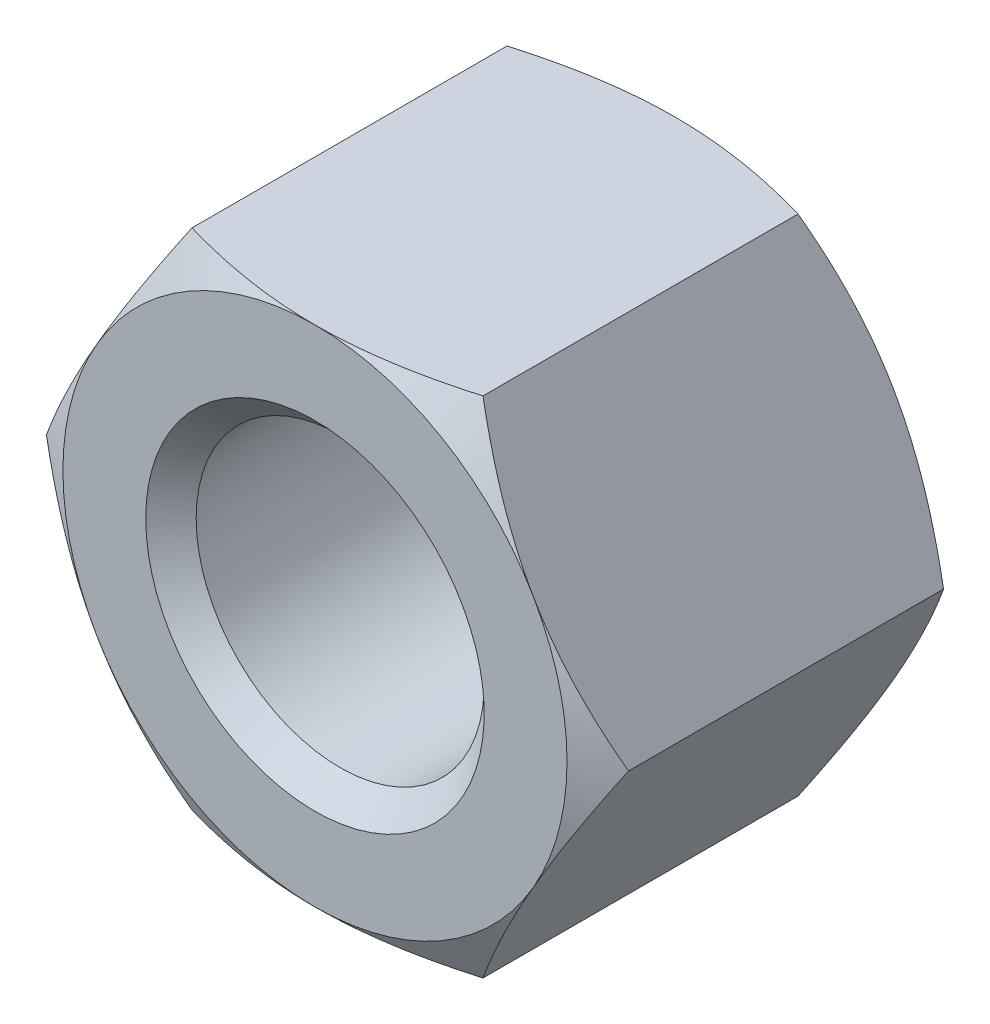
ISO-10303-21;
HEADER;
FILE_DESCRIPTION(('STEP AP214'),'2;1');
FILE_NAME('part.step','',(''),(''),'','','');
FILE_SCHEMA(('AUTOMOTIVE_DESIGN { 1 0 10303 214 1 1 1 1 }'));
ENDSEC;
DATA;
#1=APPLICATION_CONTEXT('core data for automotive mechanical design processes');
#2=APPLICATION_PROTOCOL_DEFINITION('international standard','automotive_design',2000,#1);
#3=PRODUCT_CONTEXT('',#1,'mechanical');
#4=PRODUCT('Part','Part','',(#3));
#5=PRODUCT_RELATED_PRODUCT_CATEGORY('part','',(#4));
#6=PRODUCT_DEFINITION_FORMATION('','',#4);
#7=PRODUCT_DEFINITION_CONTEXT('part definition',#1,'design');
#8=PRODUCT_DEFINITION('design','',#6,#7);
#9=PRODUCT_DEFINITION_SHAPE('','',#8);
#10=(LENGTH_UNIT() NAMED_UNIT(*) SI_UNIT(.MILLI.,.METRE.));
#11=(NAMED_UNIT(*) PLANE_ANGLE_UNIT() SI_UNIT($,.RADIAN.));
#12=(NAMED_UNIT(*) SI_UNIT($,.STERADIAN.) SOLID_ANGLE_UNIT());
#13=UNCERTAINTY_MEASURE_WITH_UNIT(LENGTH_MEASURE(1.E-05),#10,'distance_accuracy_value','');
#14=(GEOMETRIC_REPRESENTATION_CONTEXT(3) GLOBAL_UNCERTAINTY_ASSIGNED_CONTEXT((#13)) GLOBAL_UNIT_ASSIGNED_CONTEXT((#10,
#11,#12)) REPRESENTATION_CONTEXT('',''));
#15=CARTESIAN_POINT('',(0.,0.,0.));
#16=DIRECTION('',(0.,0.,1.));
#17=DIRECTION('',(1.,0.,0.));
#18=AXIS2_PLACEMENT_3D('',#15,#16,#17);
#19=CARTESIAN_POINT('',(4.04145188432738,0.,-2.5));
#20=DIRECTION('',(0.866025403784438,0.5,0.));
#21=DIRECTION('',(-0.5,0.866025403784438,0.));
#22=AXIS2_PLACEMENT_3D('',#19,#20,#21);
#23=PLANE('',#22);
#24=CARTESIAN_POINT('',(4.04156735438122,-0.000200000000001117,2.18732593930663));
#25=CARTESIAN_POINT('',(3.9527667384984,0.153607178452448,2.23861421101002));
#26=CARTESIAN_POINT('',(3.86319960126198,0.308742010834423,2.2852590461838));
#27=CARTESIAN_POINT('',(3.68251437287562,0.62169800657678,2.36667812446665));
#28=CARTESIAN_POINT('',(3.59139307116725,0.779524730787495,2.40142356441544));
#29=CARTESIAN_POINT('',(3.41027974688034,1.09322221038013,2.45550997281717));
#30=CARTESIAN_POINT('',(3.32031559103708,1.24904469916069,2.47521091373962));
#31=CARTESIAN_POINT('',(3.13996396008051,1.56142288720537,2.49872986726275));
#32=CARTESIAN_POINT('',(3.04957714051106,1.71797745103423,2.50256735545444));
#33=CARTESIAN_POINT('',(2.88068384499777,2.01050921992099,2.49458469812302));
#34=CARTESIAN_POINT('',(2.80215208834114,2.14653021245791,2.48472456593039));
#35=CARTESIAN_POINT('',(2.64560020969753,2.41768602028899,2.4534735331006));
#36=CARTESIAN_POINT('',(2.56758062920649,2.55281989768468,2.4320719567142));
#37=CARTESIAN_POINT('',(2.41070596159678,2.82453479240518,2.37856959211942));
#38=CARTESIAN_POINT('',(2.33187072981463,2.96108141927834,2.34624200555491));
#39=CARTESIAN_POINT('',(2.17537608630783,3.2321380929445,2.27287106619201));
#40=CARTESIAN_POINT('',(2.09771466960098,3.36665161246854,2.23184495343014));
#41=CARTESIAN_POINT('',(2.02061047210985,3.5002,2.18732593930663));
#42=B_SPLINE_CURVE_WITH_KNOTS('',3,(#24,#25,#26,#27,#28,#29,#30,#31,#32,#33,#34,#35,#36,#37,#38,
#39,#40,#41),.UNSPECIFIED.,.F.,.F.,(4,2,2,2,2,2,2,2,4),(0.,0.554793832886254,1.11092123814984,
1.65328467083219,2.19498204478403,2.6666513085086,3.13875761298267,3.6213361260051,
4.10296698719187),.UNSPECIFIED.);
#43=CARTESIAN_POINT('',(4.04145188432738,0.,2.18739260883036));
#44=VERTEX_POINT('',#43);
#45=CARTESIAN_POINT('',(3.03108891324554,1.75,2.5));
#46=VERTEX_POINT('',#45);
#47=EDGE_CURVE('E127',#44,#46,#42,.T.);
#48=ORIENTED_EDGE('',*,*,#47,.F.);
#49=DIRECTION('',(0.,0.,1.));
#50=VECTOR('',#49,1.);
#51=CARTESIAN_POINT('',(4.04145188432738,0.,-2.5));
#52=LINE('',#51,#50);
#53=CARTESIAN_POINT('',(4.04145188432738,0.,-2.18739260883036));
#54=VERTEX_POINT('',#53);
#55=EDGE_CURVE('E535',#54,#44,#52,.T.);
#56=ORIENTED_EDGE('',*,*,#55,.F.);
#57=CARTESIAN_POINT('',(4.04156735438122,-0.000200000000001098,-2.18732593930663));
#58=CARTESIAN_POINT('',(3.9527667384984,0.153607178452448,-2.23861421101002));
#59=CARTESIAN_POINT('',(3.86319960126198,0.308742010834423,-2.2852590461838));
#60=CARTESIAN_POINT('',(3.68251437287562,0.62169800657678,-2.36667812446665));
#61=CARTESIAN_POINT('',(3.59139307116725,0.779524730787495,-2.40142356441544));
#62=CARTESIAN_POINT('',(3.41027974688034,1.09322221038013,-2.45550997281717));
#63=CARTESIAN_POINT('',(3.32031559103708,1.24904469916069,-2.47521091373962));
#64=CARTESIAN_POINT('',(3.13996396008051,1.56142288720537,-2.49872986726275));
#65=CARTESIAN_POINT('',(3.04957714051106,1.71797745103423,-2.50256735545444));
#66=CARTESIAN_POINT('',(2.88068384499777,2.01050921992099,-2.49458469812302));
#67=CARTESIAN_POINT('',(2.80215208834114,2.14653021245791,-2.48472456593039));
#68=CARTESIAN_POINT('',(2.64560020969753,2.41768602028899,-2.4534735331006));
#69=CARTESIAN_POINT('',(2.56758062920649,2.55281989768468,-2.4320719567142));
#70=CARTESIAN_POINT('',(2.41070596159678,2.82453479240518,-2.37856959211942));
#71=CARTESIAN_POINT('',(2.33187072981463,2.96108141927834,-2.34624200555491));
#72=CARTESIAN_POINT('',(2.17537608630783,3.2321380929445,-2.27287106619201));
#73=CARTESIAN_POINT('',(2.09771466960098,3.36665161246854,-2.23184495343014));
#74=CARTESIAN_POINT('',(2.02061047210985,3.5002,-2.18732593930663));
#75=B_SPLINE_CURVE_WITH_KNOTS('',3,(#57,#58,#59,#60,#61,#62,#63,#64,#65,#66,#67,#68,#69,#70,#71,
#72,#73,#74),.UNSPECIFIED.,.F.,.F.,(4,2,2,2,2,2,2,2,4),(0.,0.554793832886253,1.11092123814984,
1.65328467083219,2.19498204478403,2.6666513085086,3.13875761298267,3.6213361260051,
4.10296698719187),.UNSPECIFIED.);
#76=CARTESIAN_POINT('',(3.03108891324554,1.75,-2.5));
#77=VERTEX_POINT('',#76);
#78=EDGE_CURVE('E569',#54,#77,#75,.T.);
#79=ORIENTED_EDGE('',*,*,#78,.T.);
#80=CARTESIAN_POINT('',(2.02072594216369,3.5,-2.18739260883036));
#81=VERTEX_POINT('',#80);
#82=EDGE_CURVE('E269',#77,#81,#75,.T.);
#83=ORIENTED_EDGE('',*,*,#82,.T.);
#84=DIRECTION('',(0.,0.,1.));
#85=VECTOR('',#84,1.);
#86=CARTESIAN_POINT('',(2.02072594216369,3.5,-2.5));
#87=LINE('',#86,#85);
#88=CARTESIAN_POINT('',(2.02072594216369,3.5,2.18739260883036));
#89=VERTEX_POINT('',#88);
#90=EDGE_CURVE('E159',#81,#89,#87,.T.);
#91=ORIENTED_EDGE('',*,*,#90,.T.);
#92=EDGE_CURVE('E140',#46,#89,#42,.T.);
#93=ORIENTED_EDGE('',*,*,#92,.F.);
#94=EDGE_LOOP('',(#48,#56,#79,#83,#91,#93));
#95=FACE_BOUND('',#94,.T.);
#96=ADVANCED_FACE('F41',(#95),#23,.T.);
#97=CARTESIAN_POINT('',(2.02072594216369,-3.5,-2.5));
#98=DIRECTION('',(0.866025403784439,-0.5,0.));
#99=DIRECTION('',(0.5,0.866025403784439,0.));
#100=AXIS2_PLACEMENT_3D('',#97,#98,#99);
#101=PLANE('',#100);
#102=CARTESIAN_POINT('',(2.02061047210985,-3.5002,2.18732593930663));
#103=CARTESIAN_POINT('',(2.10941108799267,-3.34639282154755,2.23861421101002));
#104=CARTESIAN_POINT('',(2.19897822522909,-3.19125798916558,2.2852590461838));
#105=CARTESIAN_POINT('',(2.37966345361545,-2.87830199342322,2.36667812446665));
#106=CARTESIAN_POINT('',(2.47078475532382,-2.7204752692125,2.40142356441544));
#107=CARTESIAN_POINT('',(2.65189807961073,-2.40677778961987,2.45550997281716));
#108=CARTESIAN_POINT('',(2.74186223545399,-2.25095530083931,2.47521091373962));
#109=CARTESIAN_POINT('',(2.92221386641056,-1.93857711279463,2.49872986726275));
#110=CARTESIAN_POINT('',(3.01260068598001,-1.78202254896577,2.50256735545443));
#111=CARTESIAN_POINT('',(3.1814939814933,-1.48949078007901,2.49458469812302));
#112=CARTESIAN_POINT('',(3.26002573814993,-1.35346978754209,2.48472456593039));
#113=CARTESIAN_POINT('',(3.41657761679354,-1.08231397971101,2.4534735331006));
#114=CARTESIAN_POINT('',(3.49459719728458,-0.947180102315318,2.4320719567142));
#115=CARTESIAN_POINT('',(3.65147186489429,-0.675465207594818,2.37856959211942));
#116=CARTESIAN_POINT('',(3.73030709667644,-0.538918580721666,2.34624200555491));
#117=CARTESIAN_POINT('',(3.88680174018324,-0.2678619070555,2.27287106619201));
#118=CARTESIAN_POINT('',(3.96446315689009,-0.133348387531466,2.23184495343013));
#119=CARTESIAN_POINT('',(4.04156735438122,0.000199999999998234,2.18732593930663));
#120=B_SPLINE_CURVE_WITH_KNOTS('',3,(#102,#103,#104,#105,#106,#107,#108,#109,#110,#111,#112,
#113,#114,#115,#116,#117,#118,#119),.UNSPECIFIED.,.F.,.F.,(4,2,2,2,2,2,2,2,4),(0.,
0.554793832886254,1.11092123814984,1.65328467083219,2.19498204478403,2.6666513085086,
3.13875761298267,3.62133612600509,4.10296698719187),.UNSPECIFIED.);
#121=CARTESIAN_POINT('',(2.02072594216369,-3.5,2.18739260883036));
#122=VERTEX_POINT('',#121);
#123=CARTESIAN_POINT('',(3.03108891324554,-1.75,2.5));
#124=VERTEX_POINT('',#123);
#125=EDGE_CURVE('E550',#122,#124,#120,.T.);
#126=ORIENTED_EDGE('',*,*,#125,.F.);
#127=DIRECTION('',(0.,0.,1.));
#128=VECTOR('',#127,1.);
#129=CARTESIAN_POINT('',(2.02072594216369,-3.5,-2.5));
#130=LINE('',#129,#128);
#131=CARTESIAN_POINT('',(2.02072594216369,-3.5,-2.18739260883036));
#132=VERTEX_POINT('',#131);
#133=EDGE_CURVE('E283',#132,#122,#130,.T.);
#134=ORIENTED_EDGE('',*,*,#133,.F.);
#135=CARTESIAN_POINT('',(2.02061047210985,-3.5002,-2.18732593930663));
#136=CARTESIAN_POINT('',(2.10941108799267,-3.34639282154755,-2.23861421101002));
#137=CARTESIAN_POINT('',(2.19897822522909,-3.19125798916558,-2.2852590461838));
#138=CARTESIAN_POINT('',(2.37966345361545,-2.87830199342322,-2.36667812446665));
#139=CARTESIAN_POINT('',(2.47078475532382,-2.7204752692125,-2.40142356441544));
#140=CARTESIAN_POINT('',(2.65189807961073,-2.40677778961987,-2.45550997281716));
#141=CARTESIAN_POINT('',(2.74186223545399,-2.25095530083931,-2.47521091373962));
#142=CARTESIAN_POINT('',(2.92221386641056,-1.93857711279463,-2.49872986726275));
#143=CARTESIAN_POINT('',(3.01260068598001,-1.78202254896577,-2.50256735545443));
#144=CARTESIAN_POINT('',(3.1814939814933,-1.48949078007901,-2.49458469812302));
#145=CARTESIAN_POINT('',(3.26002573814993,-1.35346978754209,-2.48472456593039));
#146=CARTESIAN_POINT('',(3.41657761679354,-1.08231397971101,-2.4534735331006));
#147=CARTESIAN_POINT('',(3.49459719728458,-0.947180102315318,-2.4320719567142));
#148=CARTESIAN_POINT('',(3.65147186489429,-0.675465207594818,-2.37856959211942));
#149=CARTESIAN_POINT('',(3.73030709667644,-0.538918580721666,-2.34624200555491));
#150=CARTESIAN_POINT('',(3.88680174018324,-0.2678619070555,-2.27287106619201));
#151=CARTESIAN_POINT('',(3.96446315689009,-0.133348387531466,-2.23184495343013));
#152=CARTESIAN_POINT('',(4.04156735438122,0.000199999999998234,-2.18732593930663));
#153=B_SPLINE_CURVE_WITH_KNOTS('',3,(#135,#136,#137,#138,#139,#140,#141,#142,#143,#144,#145,
#146,#147,#148,#149,#150,#151,#152),.UNSPECIFIED.,.F.,.F.,(4,2,2,2,2,2,2,2,4),(0.,
0.554793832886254,1.11092123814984,1.65328467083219,2.19498204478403,2.6666513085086,
3.13875761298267,3.62133612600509,4.10296698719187),.UNSPECIFIED.);
#154=CARTESIAN_POINT('',(3.03108891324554,-1.75,-2.5));
#155=VERTEX_POINT('',#154);
#156=EDGE_CURVE('E536',#132,#155,#153,.T.);
#157=ORIENTED_EDGE('',*,*,#156,.T.);
#158=EDGE_CURVE('E284',#155,#54,#153,.T.);
#159=ORIENTED_EDGE('',*,*,#158,.T.);
#160=ORIENTED_EDGE('',*,*,#55,.T.);
#161=EDGE_CURVE('E132',#124,#44,#120,.T.);
#162=ORIENTED_EDGE('',*,*,#161,.F.);
#163=EDGE_LOOP('',(#126,#134,#157,#159,#160,#162));
#164=FACE_BOUND('',#163,.T.);
#165=ADVANCED_FACE('F254',(#164),#101,.T.);
#166=CARTESIAN_POINT('',(-2.02072594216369,-3.5,-2.5));
#167=DIRECTION('',(0.,-1.,0.));
#168=DIRECTION('',(0.,0.,-1.));
#169=AXIS2_PLACEMENT_3D('',#166,#167,#168);
#170=PLANE('',#169);
#171=CARTESIAN_POINT('',(-7.9267982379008,-3.5,-0.482077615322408));
#172=CARTESIAN_POINT('',(-7.74585500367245,-3.5,-0.386521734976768));
#173=CARTESIAN_POINT('',(-7.56469853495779,-3.5,-0.291366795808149));
#174=CARTESIAN_POINT('',(-7.20185417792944,-3.5,-0.102064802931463));
#175=CARTESIAN_POINT('',(-7.02016627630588,-3.5,-0.00791777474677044));
#176=CARTESIAN_POINT('',(-6.65593697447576,-3.5,0.179273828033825));
#177=CARTESIAN_POINT('',(-6.47339479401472,-3.5,0.272316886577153));
#178=CARTESIAN_POINT('',(-6.1075482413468,-3.5,0.456892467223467));
#179=CARTESIAN_POINT('',(-5.9242438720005,-3.5,0.548424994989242));
#180=CARTESIAN_POINT('',(-5.54664352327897,-3.5,0.734564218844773));
#181=CARTESIAN_POINT('',(-5.35229516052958,-3.5,0.829064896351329));
#182=CARTESIAN_POINT('',(-4.96230623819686,-3.5,1.01537367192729));
#183=CARTESIAN_POINT('',(-4.76666566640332,-3.5,1.10718174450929));
#184=CARTESIAN_POINT('',(-4.37385366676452,-3.5,1.28723837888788));
#185=CARTESIAN_POINT('',(-4.17668297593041,-3.5,1.37548854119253));
#186=CARTESIAN_POINT('',(-3.78031667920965,-3.5,1.54730762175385));
#187=CARTESIAN_POINT('',(-3.58112119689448,-3.5,1.63087682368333));
#188=CARTESIAN_POINT('',(-3.16157019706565,-3.5,1.79916704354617));
#189=CARTESIAN_POINT('',(-2.94096601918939,-3.5,1.88327567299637));
#190=CARTESIAN_POINT('',(-2.49588109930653,-3.5,2.04090784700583));
#191=CARTESIAN_POINT('',(-2.27139918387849,-3.5,2.11442812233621));
#192=CARTESIAN_POINT('',(-1.82231733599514,-3.5,2.24519733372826));
#193=CARTESIAN_POINT('',(-1.59780434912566,-3.5,2.30273452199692));
#194=CARTESIAN_POINT('',(-1.25802721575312,-3.5,2.37429241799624));
#195=CARTESIAN_POINT('',(-1.14430805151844,-3.5,2.39568205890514));
#196=CARTESIAN_POINT('',(-0.915972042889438,-3.5,2.4329024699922));
#197=CARTESIAN_POINT('',(-0.801355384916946,-3.5,2.44873436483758));
#198=CARTESIAN_POINT('',(-0.587977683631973,-3.5,2.47244310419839));
#199=CARTESIAN_POINT('',(-0.489307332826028,-3.5,2.48113663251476));
#200=CARTESIAN_POINT('',(-0.291673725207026,-3.5,2.49378801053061));
#201=CARTESIAN_POINT('',(-0.192710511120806,-3.5,2.4977465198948));
#202=CARTESIAN_POINT('',(0.00527862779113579,-3.5,2.50080497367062));
#203=CARTESIAN_POINT('',(0.104304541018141,-3.5,2.49990564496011));
#204=CARTESIAN_POINT('',(0.302186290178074,-3.5,2.49328592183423));
#205=CARTESIAN_POINT('',(0.40104212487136,-3.5,2.48756549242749));
#206=CARTESIAN_POINT('',(0.700661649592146,-3.5,2.46309822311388));
#207=CARTESIAN_POINT('',(0.900867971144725,-3.5,2.43699536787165));
#208=CARTESIAN_POINT('',(1.19891955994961,-3.5,2.38544014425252));
#209=CARTESIAN_POINT('',(1.2979194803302,-3.5,2.36618155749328));
#210=CARTESIAN_POINT('',(1.49513477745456,-3.5,2.32398116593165));
#211=CARTESIAN_POINT('',(1.59335017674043,-3.5,2.30103946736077));
#212=CARTESIAN_POINT('',(1.83374956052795,-3.5,2.24065787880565));
#213=CARTESIAN_POINT('',(1.97547261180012,-3.5,2.20138966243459));
#214=CARTESIAN_POINT('',(2.25723868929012,-3.5,2.11721544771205));
#215=CARTESIAN_POINT('',(2.39728144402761,-3.5,2.07230855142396));
#216=CARTESIAN_POINT('',(2.67593858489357,-3.5,1.97789895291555));
#217=CARTESIAN_POINT('',(2.81455158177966,-3.5,1.92839217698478));
#218=CARTESIAN_POINT('',(3.09039174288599,-3.5,1.8257051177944));
#219=CARTESIAN_POINT('',(3.22761899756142,-3.5,1.7725250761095));
#220=CARTESIAN_POINT('',(3.50148947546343,-3.5,1.6629508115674));
#221=CARTESIAN_POINT('',(3.63812736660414,-3.5,1.60654331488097));
#222=CARTESIAN_POINT('',(3.91037121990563,-3.5,1.49128927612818));
#223=CARTESIAN_POINT('',(4.04597715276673,-3.5,1.43244266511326));
#224=CARTESIAN_POINT('',(4.45134783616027,-3.5,1.25299211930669));
#225=CARTESIAN_POINT('',(4.71979905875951,-3.5,1.1294229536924));
#226=CARTESIAN_POINT('',(5.23640668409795,-3.5,0.885272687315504));
#227=CARTESIAN_POINT('',(5.48472802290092,-3.5,0.765037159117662));
#228=CARTESIAN_POINT('',(5.97971131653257,-3.5,0.521129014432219));
#229=CARTESIAN_POINT('',(6.22637306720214,-3.5,0.397455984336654));
#230=CARTESIAN_POINT('',(6.7159028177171,-3.5,0.148850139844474));
#231=CARTESIAN_POINT('',(6.95878387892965,-3.5,0.0239429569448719));
#232=CARTESIAN_POINT('',(7.44349847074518,-3.5,-0.227773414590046));
#233=CARTESIAN_POINT('',(7.68533219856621,-3.5,-0.354582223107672));
#234=CARTESIAN_POINT('',(7.9267982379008,-3.5,-0.482077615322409));
#235=B_SPLINE_CURVE_WITH_KNOTS('',3,(#171,#172,#173,#174,#175,#176,#177,#178,#179,#180,#181,
#182,#183,#184,#185,#186,#187,#188,#189,#190,#191,#192,#193,#194,#195,#196,#197,#198,#199,#200,
#201,#202,#203,#204,#205,#206,#207,#208,#209,#210,#211,#212,#213,#214,#215,#216,#217,#218,#219,
#220,#221,#222,#223,#224,#225,#226,#227,#228,#229,#230,#231,#232,#233,#234),.UNSPECIFIED.,.F.,
.F.,(4,2,2,2,2,2,2,2,2,2,2,2,2,2,2,2,2,2,2,2,2,2,2,2,2,2,2,2,2,2,2,4),(0.,0.613876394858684,
1.22776829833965,1.84242338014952,2.45707615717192,3.10537717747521,3.75368433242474,
4.40169651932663,5.04966939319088,5.75775575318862,6.46606027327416,7.16061004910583,
7.50763711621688,7.85459391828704,8.15164543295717,8.44865555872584,8.74562124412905,
9.04258908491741,9.64730887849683,9.94982773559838,10.2523378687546,10.6933745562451,
11.1344815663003,11.5759830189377,12.0174554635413,12.4608962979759,12.9043496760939,
13.790823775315,14.6184909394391,15.4462581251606,16.2656007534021,17.0847817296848),.UNSPECIFIED.);
#236=CARTESIAN_POINT('',(-2.02072594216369,-3.5,2.18739260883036));
#237=VERTEX_POINT('',#236);
#238=CARTESIAN_POINT('',(0.,-3.5,2.5));
#239=VERTEX_POINT('',#238);
#240=EDGE_CURVE('E552',#237,#239,#235,.T.);
#241=ORIENTED_EDGE('',*,*,#240,.F.);
#242=DIRECTION('',(0.,0.,1.));
#243=VECTOR('',#242,1.);
#244=CARTESIAN_POINT('',(-2.02072594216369,-3.5,-2.5));
#245=LINE('',#244,#243);
#246=CARTESIAN_POINT('',(-2.02072594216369,-3.5,-2.18739260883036));
#247=VERTEX_POINT('',#246);
#248=EDGE_CURVE('E558',#247,#237,#245,.T.);
#249=ORIENTED_EDGE('',*,*,#248,.F.);
#250=CARTESIAN_POINT('',(-6.77311841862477,-3.5,-0.11901668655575));
#251=CARTESIAN_POINT('',(-6.61485576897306,-3.5,-0.200181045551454));
#252=CARTESIAN_POINT('',(-6.45635661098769,-3.5,-0.280888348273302));
#253=CARTESIAN_POINT('',(-6.13877792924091,-3.5,-0.441160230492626));
#254=CARTESIAN_POINT('',(-5.97969839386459,-3.5,-0.520724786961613));
#255=CARTESIAN_POINT('',(-5.66059045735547,-3.5,-0.678611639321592));
#256=CARTESIAN_POINT('',(-5.50056091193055,-3.5,-0.756931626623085));
#257=CARTESIAN_POINT('',(-5.17968001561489,-3.5,-0.911878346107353));
#258=CARTESIAN_POINT('',(-5.01882865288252,-3.5,-0.98850505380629));
#259=CARTESIAN_POINT('',(-4.68780537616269,-3.5,-1.14356384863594));
#260=CARTESIAN_POINT('',(-4.51758121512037,-3.5,-1.22188472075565));
#261=CARTESIAN_POINT('',(-4.17580796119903,-3.5,-1.37557731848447));
#262=CARTESIAN_POINT('',(-4.00425890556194,-3.5,-1.45094912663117));
#263=CARTESIAN_POINT('',(-3.65965514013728,-3.5,-1.5978523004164));
#264=CARTESIAN_POINT('',(-3.48660155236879,-3.5,-1.66938628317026));
#265=CARTESIAN_POINT('',(-3.13848654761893,-3.5,-1.80754129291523));
#266=CARTESIAN_POINT('',(-2.96342466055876,-3.5,-1.87416114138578));
#267=CARTESIAN_POINT('',(-2.58078146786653,-3.5,-2.01178713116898));
#268=CARTESIAN_POINT('',(-2.37276153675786,-3.5,-2.0815931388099));
#269=CARTESIAN_POINT('',(-1.95306292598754,-3.5,-2.20897260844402));
#270=CARTESIAN_POINT('',(-1.74138620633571,-3.5,-2.26655241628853));
#271=CARTESIAN_POINT('',(-1.31809593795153,-3.5,-2.36429064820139));
#272=CARTESIAN_POINT('',(-1.10655640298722,-3.5,-2.40475698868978));
#273=CARTESIAN_POINT('',(-0.787150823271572,-3.5,-2.45038552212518));
#274=CARTESIAN_POINT('',(-0.680342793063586,-3.5,-2.46308273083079));
#275=CARTESIAN_POINT('',(-0.46622726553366,-3.5,-2.48306196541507));
#276=CARTESIAN_POINT('',(-0.358919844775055,-3.5,-2.49034479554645));
#277=CARTESIAN_POINT('',(-0.14272203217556,-3.5,-2.49929092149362));
#278=CARTESIAN_POINT('',(-0.0338286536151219,-3.5,-2.50088265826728));
#279=CARTESIAN_POINT('',(0.183884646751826,-3.5,-2.49818887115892));
#280=CARTESIAN_POINT('',(0.292704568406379,-3.5,-2.49390333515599));
#281=CARTESIAN_POINT('',(0.509991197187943,-3.5,-2.47961211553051));
#282=CARTESIAN_POINT('',(0.618457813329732,-3.5,-2.46960506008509));
#283=CARTESIAN_POINT('',(0.83476739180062,-3.5,-2.44422186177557));
#284=CARTESIAN_POINT('',(0.942610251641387,-3.5,-2.42884486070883));
#285=CARTESIAN_POINT('',(1.26912660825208,-3.5,-2.37466734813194));
#286=CARTESIAN_POINT('',(1.48653168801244,-3.5,-2.3281298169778));
#287=CARTESIAN_POINT('',(1.91729147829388,-3.5,-2.21939979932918));
#288=CARTESIAN_POINT('',(2.130645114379,-3.5,-2.1572032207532));
#289=CARTESIAN_POINT('',(2.54010798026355,-3.5,-2.02572338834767));
#290=CARTESIAN_POINT('',(2.73644789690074,-3.5,-1.95714702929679));
#291=CARTESIAN_POINT('',(3.12639940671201,-3.5,-1.81258854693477));
#292=CARTESIAN_POINT('',(3.32001040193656,-3.5,-1.73660482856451));
#293=CARTESIAN_POINT('',(3.70517045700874,-3.5,-1.57908171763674));
#294=CARTESIAN_POINT('',(3.89671723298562,-3.5,-1.49753678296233));
#295=CARTESIAN_POINT('',(4.27797891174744,-3.5,-1.33033703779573));
#296=CARTESIAN_POINT('',(4.46769397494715,-3.5,-1.24468259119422));
#297=CARTESIAN_POINT('',(4.83534171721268,-3.5,-1.07500283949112));
#298=CARTESIAN_POINT('',(5.01335167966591,-3.5,-0.991144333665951));
#299=CARTESIAN_POINT('',(5.36831948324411,-3.5,-0.821220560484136));
#300=CARTESIAN_POINT('',(5.54527729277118,-3.5,-0.735155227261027));
#301=CARTESIAN_POINT('',(5.89779243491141,-3.5,-0.561538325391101));
#302=CARTESIAN_POINT('',(6.07335238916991,-3.5,-0.473992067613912));
#303=CARTESIAN_POINT('',(6.42374286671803,-3.5,-0.29748622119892));
#304=CARTESIAN_POINT('',(6.59857344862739,-3.5,-0.208526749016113));
#305=CARTESIAN_POINT('',(6.77311841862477,-3.5,-0.11901668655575));
#306=B_SPLINE_CURVE_WITH_KNOTS('',3,(#250,#251,#252,#253,#254,#255,#256,#257,#258,#259,#260,
#261,#262,#263,#264,#265,#266,#267,#268,#269,#270,#271,#272,#273,#274,#275,#276,#277,#278,#279,
#280,#281,#282,#283,#284,#285,#286,#287,#288,#289,#290,#291,#292,#293,#294,#295,#296,#297,#298,
#299,#300,#301,#302,#303,#304,#305),.UNSPECIFIED.,.F.,.F.,(4,2,2,2,2,2,2,2,2,2,2,2,2,2,2,2,2,2,
2,2,2,2,2,2,2,2,2,4),(0.,0.53358660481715,1.06718394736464,1.6016766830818,2.13617714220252,
2.69828840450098,3.26038392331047,3.82209113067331,4.38393261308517,5.04191488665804,
5.69955480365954,6.34479895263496,6.66736196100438,6.98987704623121,7.31643340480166,
7.64299043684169,7.96962579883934,8.29631338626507,8.9624375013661,9.62873587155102,
10.252453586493,10.8763059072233,11.5007892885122,12.1252174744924,12.7155195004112,
13.3058391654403,13.8943650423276,14.4828426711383),.UNSPECIFIED.);
#307=CARTESIAN_POINT('',(0.,-3.5,-2.5));
#308=VERTEX_POINT('',#307);
#309=EDGE_CURVE('E547',#247,#308,#306,.T.);
#310=ORIENTED_EDGE('',*,*,#309,.T.);
#311=EDGE_CURVE('E259',#308,#132,#306,.T.);
#312=ORIENTED_EDGE('',*,*,#311,.T.);
#313=ORIENTED_EDGE('',*,*,#133,.T.);
#314=EDGE_CURVE('E138',#239,#122,#235,.T.);
#315=ORIENTED_EDGE('',*,*,#314,.F.);
#316=EDGE_LOOP('',(#241,#249,#310,#312,#313,#315));
#317=FACE_BOUND('',#316,.T.);
#318=ADVANCED_FACE('F292',(#317),#170,.T.);
#319=CARTESIAN_POINT('',(-4.04145188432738,0.,-2.5));
#320=DIRECTION('',(-0.866025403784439,-0.5,0.));
#321=DIRECTION('',(0.5,-0.866025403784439,0.));
#322=AXIS2_PLACEMENT_3D('',#319,#320,#321);
#323=PLANE('',#322);
#324=CARTESIAN_POINT('',(-4.04156735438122,0.000200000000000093,2.18732593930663));
#325=CARTESIAN_POINT('',(-3.9527667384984,-0.153607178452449,2.23861421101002));
#326=CARTESIAN_POINT('',(-3.86319960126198,-0.308742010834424,2.2852590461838));
#327=CARTESIAN_POINT('',(-3.68251437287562,-0.621698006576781,2.36667812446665));
#328=CARTESIAN_POINT('',(-3.59139307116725,-0.779524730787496,2.40142356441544));
#329=CARTESIAN_POINT('',(-3.41027974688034,-1.09322221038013,2.45550997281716));
#330=CARTESIAN_POINT('',(-3.32031559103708,-1.24904469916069,2.47521091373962));
#331=CARTESIAN_POINT('',(-3.13996396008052,-1.56142288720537,2.49872986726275));
#332=CARTESIAN_POINT('',(-3.04957714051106,-1.71797745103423,2.50256735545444));
#333=CARTESIAN_POINT('',(-2.88068384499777,-2.01050921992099,2.49458469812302));
#334=CARTESIAN_POINT('',(-2.80215208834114,-2.14653021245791,2.48472456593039));
#335=CARTESIAN_POINT('',(-2.64560020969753,-2.41768602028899,2.4534735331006));
#336=CARTESIAN_POINT('',(-2.5675806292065,-2.55281989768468,2.4320719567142));
#337=CARTESIAN_POINT('',(-2.41070596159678,-2.82453479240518,2.37856959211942));
#338=CARTESIAN_POINT('',(-2.33187072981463,-2.96108141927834,2.34624200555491));
#339=CARTESIAN_POINT('',(-2.17537608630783,-3.2321380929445,2.27287106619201));
#340=CARTESIAN_POINT('',(-2.09771466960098,-3.36665161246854,2.23184495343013));
#341=CARTESIAN_POINT('',(-2.02061047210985,-3.5002,2.18732593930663));
#342=B_SPLINE_CURVE_WITH_KNOTS('',3,(#324,#325,#326,#327,#328,#329,#330,#331,#332,#333,#334,
#335,#336,#337,#338,#339,#340,#341),.UNSPECIFIED.,.F.,.F.,(4,2,2,2,2,2,2,2,4),(0.,
0.554793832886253,1.11092123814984,1.65328467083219,2.19498204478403,2.6666513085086,
3.13875761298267,3.6213361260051,4.10296698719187),.UNSPECIFIED.);
#343=CARTESIAN_POINT('',(-4.04145188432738,0.,2.18739260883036));
#344=VERTEX_POINT('',#343);
#345=CARTESIAN_POINT('',(-3.03108891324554,-1.75,2.5));
#346=VERTEX_POINT('',#345);
#347=EDGE_CURVE('E176',#344,#346,#342,.T.);
#348=ORIENTED_EDGE('',*,*,#347,.F.);
#349=DIRECTION('',(0.,0.,1.));
#350=VECTOR('',#349,1.);
#351=CARTESIAN_POINT('',(-4.04145188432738,0.,-2.5));
#352=LINE('',#351,#350);
#353=CARTESIAN_POINT('',(-4.04145188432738,0.,-2.18739260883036));
#354=VERTEX_POINT('',#353);
#355=EDGE_CURVE('E542',#354,#344,#352,.T.);
#356=ORIENTED_EDGE('',*,*,#355,.F.);
#357=CARTESIAN_POINT('',(-4.04156735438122,0.0002,-2.18732593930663));
#358=CARTESIAN_POINT('',(-3.9527667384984,-0.15360717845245,-2.23861421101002));
#359=CARTESIAN_POINT('',(-3.86319960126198,-0.308742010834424,-2.2852590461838));
#360=CARTESIAN_POINT('',(-3.68251437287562,-0.621698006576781,-2.36667812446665));
#361=CARTESIAN_POINT('',(-3.59139307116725,-0.779524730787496,-2.40142356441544));
#362=CARTESIAN_POINT('',(-3.41027974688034,-1.09322221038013,-2.45550997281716));
#363=CARTESIAN_POINT('',(-3.32031559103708,-1.24904469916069,-2.47521091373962));
#364=CARTESIAN_POINT('',(-3.13996396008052,-1.56142288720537,-2.49872986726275));
#365=CARTESIAN_POINT('',(-3.04957714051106,-1.71797745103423,-2.50256735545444));
#366=CARTESIAN_POINT('',(-2.88068384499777,-2.01050921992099,-2.49458469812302));
#367=CARTESIAN_POINT('',(-2.80215208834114,-2.14653021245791,-2.48472456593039));
#368=CARTESIAN_POINT('',(-2.64560020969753,-2.41768602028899,-2.4534735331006));
#369=CARTESIAN_POINT('',(-2.5675806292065,-2.55281989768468,-2.4320719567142));
#370=CARTESIAN_POINT('',(-2.41070596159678,-2.82453479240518,-2.37856959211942));
#371=CARTESIAN_POINT('',(-2.33187072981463,-2.96108141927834,-2.34624200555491));
#372=CARTESIAN_POINT('',(-2.17537608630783,-3.2321380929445,-2.27287106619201));
#373=CARTESIAN_POINT('',(-2.09771466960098,-3.36665161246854,-2.23184495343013));
#374=CARTESIAN_POINT('',(-2.02061047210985,-3.5002,-2.18732593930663));
#375=B_SPLINE_CURVE_WITH_KNOTS('',3,(#357,#358,#359,#360,#361,#362,#363,#364,#365,#366,#367,
#368,#369,#370,#371,#372,#373,#374),.UNSPECIFIED.,.F.,.F.,(4,2,2,2,2,2,2,2,4),(0.,
0.554793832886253,1.11092123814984,1.65328467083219,2.19498204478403,2.6666513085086,
3.13875761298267,3.6213361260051,4.10296698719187),.UNSPECIFIED.);
#376=CARTESIAN_POINT('',(-3.03108891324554,-1.75,-2.5));
#377=VERTEX_POINT('',#376);
#378=EDGE_CURVE('E275',#354,#377,#375,.T.);
#379=ORIENTED_EDGE('',*,*,#378,.T.);
#380=EDGE_CURVE('E282',#377,#247,#375,.T.);
#381=ORIENTED_EDGE('',*,*,#380,.T.);
#382=ORIENTED_EDGE('',*,*,#248,.T.);
#383=EDGE_CURVE('E554',#346,#237,#342,.T.);
#384=ORIENTED_EDGE('',*,*,#383,.F.);
#385=EDGE_LOOP('',(#348,#356,#379,#381,#382,#384));
#386=FACE_BOUND('',#385,.T.);
#387=ADVANCED_FACE('F289',(#386),#323,.T.);
#388=CARTESIAN_POINT('',(-2.02072594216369,3.5,-2.5));
#389=DIRECTION('',(-0.866025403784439,0.5,0.));
#390=DIRECTION('',(-0.5,-0.866025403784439,0.));
#391=AXIS2_PLACEMENT_3D('',#388,#389,#390);
#392=PLANE('',#391);
#393=CARTESIAN_POINT('',(-2.02061047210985,3.5002,2.18732593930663));
#394=CARTESIAN_POINT('',(-2.10941108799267,3.34639282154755,2.23861421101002));
#395=CARTESIAN_POINT('',(-2.19897822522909,3.19125798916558,2.2852590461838));
#396=CARTESIAN_POINT('',(-2.37966345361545,2.87830199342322,2.36667812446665));
#397=CARTESIAN_POINT('',(-2.47078475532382,2.7204752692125,2.40142356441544));
#398=CARTESIAN_POINT('',(-2.65189807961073,2.40677778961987,2.45550997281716));
#399=CARTESIAN_POINT('',(-2.74186223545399,2.25095530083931,2.47521091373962));
#400=CARTESIAN_POINT('',(-2.92221386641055,1.93857711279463,2.49872986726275));
#401=CARTESIAN_POINT('',(-3.01260068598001,1.78202254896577,2.50256735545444));
#402=CARTESIAN_POINT('',(-3.1814939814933,1.48949078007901,2.49458469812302));
#403=CARTESIAN_POINT('',(-3.26002573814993,1.35346978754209,2.48472456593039));
#404=CARTESIAN_POINT('',(-3.41657761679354,1.08231397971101,2.4534735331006));
#405=CARTESIAN_POINT('',(-3.49459719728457,0.947180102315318,2.4320719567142));
#406=CARTESIAN_POINT('',(-3.65147186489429,0.675465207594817,2.37856959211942));
#407=CARTESIAN_POINT('',(-3.73030709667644,0.538918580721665,2.34624200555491));
#408=CARTESIAN_POINT('',(-3.88680174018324,0.267861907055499,2.27287106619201));
#409=CARTESIAN_POINT('',(-3.96446315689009,0.133348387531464,2.23184495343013));
#410=CARTESIAN_POINT('',(-4.04156735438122,-0.000199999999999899,2.18732593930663));
#411=B_SPLINE_CURVE_WITH_KNOTS('',3,(#393,#394,#395,#396,#397,#398,#399,#400,#401,#402,#403,
#404,#405,#406,#407,#408,#409,#410),.UNSPECIFIED.,.F.,.F.,(4,2,2,2,2,2,2,2,4),(0.,
0.554793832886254,1.11092123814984,1.65328467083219,2.19498204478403,2.6666513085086,
3.13875761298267,3.62133612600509,4.10296698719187),.UNSPECIFIED.);
#412=CARTESIAN_POINT('',(-2.02072594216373,3.5,2.18739260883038));
#413=VERTEX_POINT('',#412);
#414=CARTESIAN_POINT('',(-3.03108891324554,1.75,2.5));
#415=VERTEX_POINT('',#414);
#416=EDGE_CURVE('E183',#413,#415,#411,.T.);
#417=ORIENTED_EDGE('',*,*,#416,.F.);
#418=DIRECTION('',(0.,0.,1.));
#419=VECTOR('',#418,1.);
#420=CARTESIAN_POINT('',(-2.02072594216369,3.5,-2.5));
#421=LINE('',#420,#419);
#422=CARTESIAN_POINT('',(-2.02072594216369,3.5,-2.18739260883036));
#423=VERTEX_POINT('',#422);
#424=EDGE_CURVE('E233',#423,#413,#421,.T.);
#425=ORIENTED_EDGE('',*,*,#424,.F.);
#426=CARTESIAN_POINT('',(-2.02061047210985,3.5002,-2.18732593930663));
#427=CARTESIAN_POINT('',(-2.10941108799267,3.34639282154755,-2.23861421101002));
#428=CARTESIAN_POINT('',(-2.19897822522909,3.19125798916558,-2.2852590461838));
#429=CARTESIAN_POINT('',(-2.37966345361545,2.87830199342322,-2.36667812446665));
#430=CARTESIAN_POINT('',(-2.47078475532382,2.7204752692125,-2.40142356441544));
#431=CARTESIAN_POINT('',(-2.65189807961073,2.40677778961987,-2.45550997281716));
#432=CARTESIAN_POINT('',(-2.74186223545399,2.25095530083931,-2.47521091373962));
#433=CARTESIAN_POINT('',(-2.92221386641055,1.93857711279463,-2.49872986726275));
#434=CARTESIAN_POINT('',(-3.01260068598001,1.78202254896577,-2.50256735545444));
#435=CARTESIAN_POINT('',(-3.1814939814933,1.48949078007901,-2.49458469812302));
#436=CARTESIAN_POINT('',(-3.26002573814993,1.35346978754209,-2.48472456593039));
#437=CARTESIAN_POINT('',(-3.41657761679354,1.08231397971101,-2.4534735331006));
#438=CARTESIAN_POINT('',(-3.49459719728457,0.947180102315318,-2.4320719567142));
#439=CARTESIAN_POINT('',(-3.65147186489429,0.675465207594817,-2.37856959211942));
#440=CARTESIAN_POINT('',(-3.73030709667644,0.538918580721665,-2.34624200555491));
#441=CARTESIAN_POINT('',(-3.88680174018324,0.267861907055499,-2.27287106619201));
#442=CARTESIAN_POINT('',(-3.96446315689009,0.133348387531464,-2.23184495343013));
#443=CARTESIAN_POINT('',(-4.04156735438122,-0.000199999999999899,-2.18732593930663));
#444=B_SPLINE_CURVE_WITH_KNOTS('',3,(#426,#427,#428,#429,#430,#431,#432,#433,#434,#435,#436,
#437,#438,#439,#440,#441,#442,#443),.UNSPECIFIED.,.F.,.F.,(4,2,2,2,2,2,2,2,4),(0.,
0.554793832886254,1.11092123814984,1.65328467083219,2.19498204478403,2.6666513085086,
3.13875761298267,3.62133612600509,4.10296698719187),.UNSPECIFIED.);
#445=CARTESIAN_POINT('',(-3.03108891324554,1.75,-2.5));
#446=VERTEX_POINT('',#445);
#447=EDGE_CURVE('E237',#423,#446,#444,.T.);
#448=ORIENTED_EDGE('',*,*,#447,.T.);
#449=EDGE_CURVE('E545',#446,#354,#444,.T.);
#450=ORIENTED_EDGE('',*,*,#449,.T.);
#451=ORIENTED_EDGE('',*,*,#355,.T.);
#452=EDGE_CURVE('E540',#415,#344,#411,.T.);
#453=ORIENTED_EDGE('',*,*,#452,.F.);
#454=EDGE_LOOP('',(#417,#425,#448,#450,#451,#453));
#455=FACE_BOUND('',#454,.T.);
#456=ADVANCED_FACE('F218',(#455),#392,.T.);
#457=CARTESIAN_POINT('',(2.02072594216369,3.5,-2.5));
#458=DIRECTION('',(0.,1.,0.));
#459=DIRECTION('',(-1.,0.,0.));
#460=AXIS2_PLACEMENT_3D('',#457,#458,#459);
#461=PLANE('',#460);
#462=CARTESIAN_POINT('',(7.92679823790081,3.5,-0.482077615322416));
#463=CARTESIAN_POINT('',(7.74585500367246,3.5,-0.386521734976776));
#464=CARTESIAN_POINT('',(7.56469853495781,3.5,-0.291366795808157));
#465=CARTESIAN_POINT('',(7.20185417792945,3.5,-0.102064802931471));
#466=CARTESIAN_POINT('',(7.02016627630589,3.5,-0.00791777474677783));
#467=CARTESIAN_POINT('',(6.65593697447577,3.5,0.179273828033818));
#468=CARTESIAN_POINT('',(6.47339479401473,3.5,0.272316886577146));
#469=CARTESIAN_POINT('',(6.10754824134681,3.5,0.456892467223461));
#470=CARTESIAN_POINT('',(5.92424387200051,3.5,0.548424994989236));
#471=CARTESIAN_POINT('',(5.54664352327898,3.5,0.734564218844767));
#472=CARTESIAN_POINT('',(5.35229516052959,3.5,0.829064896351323));
#473=CARTESIAN_POINT('',(4.96230623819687,3.5,1.01537367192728));
#474=CARTESIAN_POINT('',(4.76666566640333,3.5,1.10718174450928));
#475=CARTESIAN_POINT('',(4.37385366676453,3.5,1.28723837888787));
#476=CARTESIAN_POINT('',(4.17668297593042,3.5,1.37548854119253));
#477=CARTESIAN_POINT('',(3.78031667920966,3.5,1.54730762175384));
#478=CARTESIAN_POINT('',(3.58112119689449,3.5,1.63087682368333));
#479=CARTESIAN_POINT('',(3.16157019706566,3.5,1.79916704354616));
#480=CARTESIAN_POINT('',(2.9409660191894,3.5,1.88327567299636));
#481=CARTESIAN_POINT('',(2.49588109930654,3.5,2.04090784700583));
#482=CARTESIAN_POINT('',(2.27139918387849,3.5,2.1144281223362));
#483=CARTESIAN_POINT('',(1.82231733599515,3.5,2.24519733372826));
#484=CARTESIAN_POINT('',(1.59780434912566,3.5,2.30273452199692));
#485=CARTESIAN_POINT('',(1.25802721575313,3.5,2.37429241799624));
#486=CARTESIAN_POINT('',(1.14430805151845,3.5,2.39568205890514));
#487=CARTESIAN_POINT('',(0.915972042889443,3.5,2.4329024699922));
#488=CARTESIAN_POINT('',(0.801355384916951,3.5,2.44873436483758));
#489=CARTESIAN_POINT('',(0.587977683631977,3.5,2.47244310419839));
#490=CARTESIAN_POINT('',(0.489307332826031,3.5,2.48113663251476));
#491=CARTESIAN_POINT('',(0.291673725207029,3.5,2.49378801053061));
#492=CARTESIAN_POINT('',(0.19271051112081,3.5,2.4977465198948));
#493=CARTESIAN_POINT('',(-0.00527862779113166,3.5,2.50080497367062));
#494=CARTESIAN_POINT('',(-0.104304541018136,3.5,2.49990564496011));
#495=CARTESIAN_POINT('',(-0.30218629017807,3.5,2.49328592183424));
#496=CARTESIAN_POINT('',(-0.401042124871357,3.5,2.48756549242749));
#497=CARTESIAN_POINT('',(-0.700661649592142,3.5,2.46309822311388));
#498=CARTESIAN_POINT('',(-0.900867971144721,3.5,2.43699536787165));
#499=CARTESIAN_POINT('',(-1.1989195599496,3.5,2.38544014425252));
#500=CARTESIAN_POINT('',(-1.29791948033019,3.5,2.36618155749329));
#501=CARTESIAN_POINT('',(-1.49513477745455,3.5,2.32398116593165));
#502=CARTESIAN_POINT('',(-1.59335017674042,3.5,2.30103946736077));
#503=CARTESIAN_POINT('',(-1.83374956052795,3.5,2.24065787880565));
#504=CARTESIAN_POINT('',(-1.97547261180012,3.5,2.20138966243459));
#505=CARTESIAN_POINT('',(-2.25723868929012,3.5,2.11721544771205));
#506=CARTESIAN_POINT('',(-2.39728144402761,3.5,2.07230855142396));
#507=CARTESIAN_POINT('',(-2.67593858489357,3.5,1.97789895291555));
#508=CARTESIAN_POINT('',(-2.81455158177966,3.5,1.92839217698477));
#509=CARTESIAN_POINT('',(-3.090391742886,3.5,1.8257051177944));
#510=CARTESIAN_POINT('',(-3.22761899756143,3.5,1.7725250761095));
#511=CARTESIAN_POINT('',(-3.50148947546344,3.5,1.66295081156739));
#512=CARTESIAN_POINT('',(-3.63812736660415,3.5,1.60654331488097));
#513=CARTESIAN_POINT('',(-3.91037121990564,3.5,1.49128927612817));
#514=CARTESIAN_POINT('',(-4.04597715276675,3.5,1.43244266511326));
#515=CARTESIAN_POINT('',(-4.45134783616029,3.5,1.25299211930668));
#516=CARTESIAN_POINT('',(-4.71979905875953,3.5,1.12942295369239));
#517=CARTESIAN_POINT('',(-5.23640668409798,3.5,0.885272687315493));
#518=CARTESIAN_POINT('',(-5.48472802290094,3.5,0.76503715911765));
#519=CARTESIAN_POINT('',(-5.9797113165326,3.5,0.521129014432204));
#520=CARTESIAN_POINT('',(-6.22637306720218,3.5,0.397455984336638));
#521=CARTESIAN_POINT('',(-6.71590281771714,3.5,0.148850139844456));
#522=CARTESIAN_POINT('',(-6.95878387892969,3.5,0.0239429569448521));
#523=CARTESIAN_POINT('',(-7.44349847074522,3.5,-0.227773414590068));
#524=CARTESIAN_POINT('',(-7.68533219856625,3.5,-0.354582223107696));
#525=CARTESIAN_POINT('',(-7.92679823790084,3.5,-0.482077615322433));
#526=B_SPLINE_CURVE_WITH_KNOTS('',3,(#462,#463,#464,#465,#466,#467,#468,#469,#470,#471,#472,
#473,#474,#475,#476,#477,#478,#479,#480,#481,#482,#483,#484,#485,#486,#487,#488,#489,#490,#491,
#492,#493,#494,#495,#496,#497,#498,#499,#500,#501,#502,#503,#504,#505,#506,#507,#508,#509,#510,
#511,#512,#513,#514,#515,#516,#517,#518,#519,#520,#521,#522,#523,#524,#525),.UNSPECIFIED.,.F.,
.F.,(4,2,2,2,2,2,2,2,2,2,2,2,2,2,2,2,2,2,2,2,2,2,2,2,2,2,2,2,2,2,2,4),(0.,0.613876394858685,
1.22776829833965,1.84242338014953,2.45707615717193,3.10537717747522,3.75368433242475,
4.40169651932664,5.04966939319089,5.75775575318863,6.46606027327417,7.16061004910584,
7.50763711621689,7.85459391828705,8.15164543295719,8.44865555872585,8.74562124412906,
9.04258908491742,9.64730887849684,9.94982773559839,10.2523378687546,10.6933745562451,
11.1344815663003,11.5759830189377,12.0174554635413,12.4608962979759,12.9043496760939,
13.790823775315,14.6184909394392,15.4462581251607,16.2656007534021,17.0847817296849),.UNSPECIFIED.);
#527=CARTESIAN_POINT('',(0.,3.5,2.5));
#528=VERTEX_POINT('',#527);
#529=EDGE_CURVE('E145',#89,#528,#526,.T.);
#530=ORIENTED_EDGE('',*,*,#529,.F.);
#531=ORIENTED_EDGE('',*,*,#90,.F.);
#532=CARTESIAN_POINT('',(6.77311841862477,3.5,-0.119016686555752));
#533=CARTESIAN_POINT('',(6.61485576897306,3.5,-0.200181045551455));
#534=CARTESIAN_POINT('',(6.45635661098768,3.5,-0.280888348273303));
#535=CARTESIAN_POINT('',(6.1387779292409,3.5,-0.441160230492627));
#536=CARTESIAN_POINT('',(5.97969839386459,3.5,-0.520724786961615));
#537=CARTESIAN_POINT('',(5.66059045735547,3.5,-0.678611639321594));
#538=CARTESIAN_POINT('',(5.50056091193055,3.5,-0.756931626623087));
#539=CARTESIAN_POINT('',(5.17968001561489,3.5,-0.911878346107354));
#540=CARTESIAN_POINT('',(5.01882865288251,3.5,-0.988505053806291));
#541=CARTESIAN_POINT('',(4.68780537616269,3.5,-1.14356384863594));
#542=CARTESIAN_POINT('',(4.51758121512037,3.5,-1.22188472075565));
#543=CARTESIAN_POINT('',(4.17580796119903,3.5,-1.37557731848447));
#544=CARTESIAN_POINT('',(4.00425890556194,3.5,-1.45094912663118));
#545=CARTESIAN_POINT('',(3.65965514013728,3.5,-1.5978523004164));
#546=CARTESIAN_POINT('',(3.48660155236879,3.5,-1.66938628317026));
#547=CARTESIAN_POINT('',(3.13848654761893,3.5,-1.80754129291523));
#548=CARTESIAN_POINT('',(2.96342466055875,3.5,-1.87416114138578));
#549=CARTESIAN_POINT('',(2.58078146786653,3.5,-2.01178713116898));
#550=CARTESIAN_POINT('',(2.37276153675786,3.5,-2.0815931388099));
#551=CARTESIAN_POINT('',(1.95306292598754,3.5,-2.20897260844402));
#552=CARTESIAN_POINT('',(1.7413862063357,3.5,-2.26655241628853));
#553=CARTESIAN_POINT('',(1.31809593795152,3.5,-2.36429064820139));
#554=CARTESIAN_POINT('',(1.10655640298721,3.5,-2.40475698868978));
#555=CARTESIAN_POINT('',(0.787150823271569,3.5,-2.45038552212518));
#556=CARTESIAN_POINT('',(0.680342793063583,3.5,-2.4630827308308));
#557=CARTESIAN_POINT('',(0.466227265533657,3.5,-2.48306196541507));
#558=CARTESIAN_POINT('',(0.358919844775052,3.5,-2.49034479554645));
#559=CARTESIAN_POINT('',(0.142722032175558,3.5,-2.49929092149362));
#560=CARTESIAN_POINT('',(0.0338286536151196,3.5,-2.50088265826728));
#561=CARTESIAN_POINT('',(-0.183884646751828,3.5,-2.49818887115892));
#562=CARTESIAN_POINT('',(-0.292704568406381,3.5,-2.49390333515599));
#563=CARTESIAN_POINT('',(-0.509991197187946,3.5,-2.47961211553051));
#564=CARTESIAN_POINT('',(-0.618457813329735,3.5,-2.46960506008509));
#565=CARTESIAN_POINT('',(-0.834767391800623,3.5,-2.44422186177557));
#566=CARTESIAN_POINT('',(-0.94261025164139,3.5,-2.42884486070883));
#567=CARTESIAN_POINT('',(-1.26912660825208,3.5,-2.37466734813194));
#568=CARTESIAN_POINT('',(-1.48653168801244,3.5,-2.3281298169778));
#569=CARTESIAN_POINT('',(-1.91729147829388,3.5,-2.21939979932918));
#570=CARTESIAN_POINT('',(-2.130645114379,3.5,-2.1572032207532));
#571=CARTESIAN_POINT('',(-2.54010798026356,3.5,-2.02572338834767));
#572=CARTESIAN_POINT('',(-2.73644789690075,3.5,-1.95714702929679));
#573=CARTESIAN_POINT('',(-3.12639940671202,3.5,-1.81258854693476));
#574=CARTESIAN_POINT('',(-3.32001040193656,3.5,-1.73660482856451));
#575=CARTESIAN_POINT('',(-3.70517045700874,3.5,-1.57908171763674));
#576=CARTESIAN_POINT('',(-3.89671723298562,3.5,-1.49753678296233));
#577=CARTESIAN_POINT('',(-4.27797891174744,3.5,-1.33033703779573));
#578=CARTESIAN_POINT('',(-4.46769397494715,3.5,-1.24468259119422));
#579=CARTESIAN_POINT('',(-4.83534171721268,3.5,-1.07500283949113));
#580=CARTESIAN_POINT('',(-5.01335167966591,3.5,-0.991144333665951));
#581=CARTESIAN_POINT('',(-5.36831948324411,3.5,-0.821220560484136));
#582=CARTESIAN_POINT('',(-5.54527729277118,3.5,-0.735155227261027));
#583=CARTESIAN_POINT('',(-5.89779243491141,3.5,-0.561538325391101));
#584=CARTESIAN_POINT('',(-6.07335238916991,3.5,-0.473992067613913));
#585=CARTESIAN_POINT('',(-6.42374286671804,3.5,-0.29748622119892));
#586=CARTESIAN_POINT('',(-6.59857344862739,3.5,-0.208526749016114));
#587=CARTESIAN_POINT('',(-6.77311841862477,3.5,-0.11901668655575));
#588=B_SPLINE_CURVE_WITH_KNOTS('',3,(#532,#533,#534,#535,#536,#537,#538,#539,#540,#541,#542,
#543,#544,#545,#546,#547,#548,#549,#550,#551,#552,#553,#554,#555,#556,#557,#558,#559,#560,#561,
#562,#563,#564,#565,#566,#567,#568,#569,#570,#571,#572,#573,#574,#575,#576,#577,#578,#579,#580,
#581,#582,#583,#584,#585,#586,#587),.UNSPECIFIED.,.F.,.F.,(4,2,2,2,2,2,2,2,2,2,2,2,2,2,2,2,2,2,
2,2,2,2,2,2,2,2,2,4),(0.,0.53358660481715,1.06718394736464,1.6016766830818,2.13617714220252,
2.69828840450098,3.26038392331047,3.82209113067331,4.38393261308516,5.04191488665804,
5.69955480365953,6.34479895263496,6.66736196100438,6.98987704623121,7.31643340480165,
7.64299043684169,7.96962579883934,8.29631338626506,8.9624375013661,9.62873587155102,
10.252453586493,10.8763059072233,11.5007892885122,12.1252174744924,12.7155195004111,
13.3058391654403,13.8943650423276,14.4828426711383),.UNSPECIFIED.);
#589=CARTESIAN_POINT('',(0.,3.5,-2.5));
#590=VERTEX_POINT('',#589);
#591=EDGE_CURVE('E234',#81,#590,#588,.T.);
#592=ORIENTED_EDGE('',*,*,#591,.T.);
#593=EDGE_CURVE('E223',#590,#423,#588,.T.);
#594=ORIENTED_EDGE('',*,*,#593,.T.);
#595=ORIENTED_EDGE('',*,*,#424,.T.);
#596=EDGE_CURVE('E161',#528,#413,#526,.T.);
#597=ORIENTED_EDGE('',*,*,#596,.F.);
#598=EDGE_LOOP('',(#530,#531,#592,#594,#595,#597));
#599=FACE_BOUND('',#598,.T.);
#600=ADVANCED_FACE('F214',(#599),#461,.T.);
#601=CARTESIAN_POINT('',(0.,0.,-2.5));
#602=DIRECTION('',(0.,0.,1.));
#603=DIRECTION('',(-1.,0.,0.));
#604=AXIS2_PLACEMENT_3D('',#601,#602,#603);
#605=CONICAL_SURFACE('',#604,3.5,1.0471975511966);
#606=CARTESIAN_POINT('',(0.,0.,-2.5));
#607=DIRECTION('',(0.,0.,1.));
#608=DIRECTION('',(1.,0.,0.));
#609=AXIS2_PLACEMENT_3D('',#606,#607,#608);
#610=CIRCLE('',#609,3.5);
#611=EDGE_CURVE('E532',#155,#77,#610,.T.);
#612=ORIENTED_EDGE('',*,*,#611,.T.);
#613=ORIENTED_EDGE('',*,*,#78,.F.);
#614=ORIENTED_EDGE('',*,*,#158,.F.);
#615=EDGE_LOOP('',(#612,#613,#614));
#616=FACE_BOUND('',#615,.T.);
#617=ADVANCED_FACE('F217',(#616),#605,.T.);
#618=EDGE_CURVE('E567',#308,#155,#610,.T.);
#619=ORIENTED_EDGE('',*,*,#618,.T.);
#620=ORIENTED_EDGE('',*,*,#156,.F.);
#621=ORIENTED_EDGE('',*,*,#311,.F.);
#622=EDGE_LOOP('',(#619,#620,#621));
#623=FACE_BOUND('',#622,.T.);
#624=ADVANCED_FACE('F337',(#623),#605,.T.);
#625=ORIENTED_EDGE('',*,*,#380,.F.);
#626=EDGE_CURVE('E596',#377,#308,#610,.T.);
#627=ORIENTED_EDGE('',*,*,#626,.T.);
#628=ORIENTED_EDGE('',*,*,#309,.F.);
#629=EDGE_LOOP('',(#625,#627,#628));
#630=FACE_BOUND('',#629,.T.);
#631=ADVANCED_FACE('F251',(#630),#605,.T.);
#632=ORIENTED_EDGE('',*,*,#449,.F.);
#633=EDGE_CURVE('E531',#446,#377,#610,.T.);
#634=ORIENTED_EDGE('',*,*,#633,.T.);
#635=ORIENTED_EDGE('',*,*,#378,.F.);
#636=EDGE_LOOP('',(#632,#634,#635));
#637=FACE_BOUND('',#636,.T.);
#638=ADVANCED_FACE('F249',(#637),#605,.T.);
#639=ORIENTED_EDGE('',*,*,#593,.F.);
#640=CARTESIAN_POINT('',(0.,0.,-2.5));
#641=DIRECTION('',(0.,0.,-1.));
#642=DIRECTION('',(-1.,0.,0.));
#643=AXIS2_PLACEMENT_3D('',#640,#641,#642);
#644=CIRCLE('',#643,3.5);
#645=EDGE_CURVE('E235',#446,#590,#644,.T.);
#646=ORIENTED_EDGE('',*,*,#645,.F.);
#647=ORIENTED_EDGE('',*,*,#447,.F.);
#648=EDGE_LOOP('',(#639,#646,#647));
#649=FACE_BOUND('',#648,.T.);
#650=ADVANCED_FACE('F243',(#649),#605,.T.);
#651=EDGE_CURVE('E527',#77,#590,#610,.T.);
#652=ORIENTED_EDGE('',*,*,#651,.T.);
#653=ORIENTED_EDGE('',*,*,#591,.F.);
#654=ORIENTED_EDGE('',*,*,#82,.F.);
#655=EDGE_LOOP('',(#652,#653,#654));
#656=FACE_BOUND('',#655,.T.);
#657=ADVANCED_FACE('F248',(#656),#605,.T.);
#658=CARTESIAN_POINT('',(0.,0.,-2.5));
#659=DIRECTION('',(0.,0.,1.));
#660=DIRECTION('',(1.,0.,0.));
#661=AXIS2_PLACEMENT_3D('',#658,#659,#660);
#662=PLANE('',#661);
#663=CARTESIAN_POINT('',(0.,0.,-2.5));
#664=DIRECTION('',(0.,0.,1.));
#665=DIRECTION('',(1.,0.,0.));
#666=AXIS2_PLACEMENT_3D('',#663,#664,#665);
#667=CIRCLE('',#666,2.35);
#668=CARTESIAN_POINT('',(2.35,0.,-2.5));
#669=VERTEX_POINT('',#668);
#670=EDGE_CURVE('E530',#669,#669,#667,.T.);
#671=ORIENTED_EDGE('',*,*,#670,.T.);
#672=EDGE_LOOP('',(#671));
#673=FACE_BOUND('',#672,.T.);
#674=ORIENTED_EDGE('',*,*,#651,.F.);
#675=ORIENTED_EDGE('',*,*,#611,.F.);
#676=ORIENTED_EDGE('',*,*,#618,.F.);
#677=ORIENTED_EDGE('',*,*,#626,.F.);
#678=ORIENTED_EDGE('',*,*,#633,.F.);
#679=ORIENTED_EDGE('',*,*,#645,.T.);
#680=EDGE_LOOP('',(#674,#675,#676,#677,#678,#679));
#681=FACE_BOUND('',#680,.T.);
#682=ADVANCED_FACE('F371',(#673,#681),#662,.F.);
#683=CARTESIAN_POINT('',(0.,0.,0.));
#684=DIRECTION('',(0.,0.,-1.));
#685=DIRECTION('',(-1.,0.,0.));
#686=AXIS2_PLACEMENT_3D('',#683,#684,#685);
#687=CYLINDRICAL_SURFACE('',#686,2.);
#688=CARTESIAN_POINT('',(0.,0.,2.15));
#689=DIRECTION('',(0.,0.,-1.));
#690=DIRECTION('',(-1.,0.,0.));
#691=AXIS2_PLACEMENT_3D('',#688,#689,#690);
#692=CIRCLE('',#691,2.);
#693=CARTESIAN_POINT('',(-2.,0.,2.15));
#694=VERTEX_POINT('',#693);
#695=EDGE_CURVE('E12',#694,#694,#692,.F.);
#696=ORIENTED_EDGE('',*,*,#695,.T.);
#697=EDGE_LOOP('',(#696));
#698=FACE_BOUND('',#697,.T.);
#699=CARTESIAN_POINT('',(0.,0.,-2.15));
#700=DIRECTION('',(0.,0.,1.));
#701=DIRECTION('',(1.,0.,0.));
#702=AXIS2_PLACEMENT_3D('',#699,#700,#701);
#703=CIRCLE('',#702,2.);
#704=CARTESIAN_POINT('',(2.,0.,-2.15));
#705=VERTEX_POINT('',#704);
#706=EDGE_CURVE('E570',#705,#705,#703,.F.);
#707=ORIENTED_EDGE('',*,*,#706,.T.);
#708=EDGE_LOOP('',(#707));
#709=FACE_BOUND('',#708,.T.);
#710=ADVANCED_FACE('F252',(#698,#709),#687,.F.);
#711=CARTESIAN_POINT('',(0.,0.,-2.15));
#712=DIRECTION('',(0.,0.,-1.));
#713=DIRECTION('',(-1.,0.,0.));
#714=AXIS2_PLACEMENT_3D('',#711,#712,#713);
#715=CONICAL_SURFACE('',#714,2.,0.78539816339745);
#716=ORIENTED_EDGE('',*,*,#670,.F.);
#717=EDGE_LOOP('',(#716));
#718=FACE_BOUND('',#717,.T.);
#719=ORIENTED_EDGE('',*,*,#706,.F.);
#720=EDGE_LOOP('',(#719));
#721=FACE_BOUND('',#720,.T.);
#722=ADVANCED_FACE('F386',(#718,#721),#715,.F.);
#723=CARTESIAN_POINT('',(0.,0.,2.5));
#724=DIRECTION('',(0.,0.,-1.));
#725=DIRECTION('',(-1.,0.,0.));
#726=AXIS2_PLACEMENT_3D('',#723,#724,#725);
#727=CONICAL_SURFACE('',#726,3.5,1.0471975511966);
#728=ORIENTED_EDGE('',*,*,#347,.T.);
#729=CARTESIAN_POINT('',(0.,0.,2.5));
#730=DIRECTION('',(0.,0.,-1.));
#731=DIRECTION('',(-1.,0.,0.));
#732=AXIS2_PLACEMENT_3D('',#729,#730,#731);
#733=CIRCLE('',#732,3.5);
#734=EDGE_CURVE('E149',#415,#346,#733,.F.);
#735=ORIENTED_EDGE('',*,*,#734,.F.);
#736=ORIENTED_EDGE('',*,*,#452,.T.);
#737=EDGE_LOOP('',(#728,#735,#736));
#738=FACE_BOUND('',#737,.T.);
#739=ADVANCED_FACE('F194',(#738),#727,.T.);
#740=ORIENTED_EDGE('',*,*,#416,.T.);
#741=CARTESIAN_POINT('',(0.,0.,2.5));
#742=DIRECTION('',(0.,0.,-1.));
#743=DIRECTION('',(-1.,0.,0.));
#744=AXIS2_PLACEMENT_3D('',#741,#742,#743);
#745=CIRCLE('',#744,3.5);
#746=EDGE_CURVE('E167',#415,#528,#745,.T.);
#747=ORIENTED_EDGE('',*,*,#746,.T.);
#748=ORIENTED_EDGE('',*,*,#596,.T.);
#749=EDGE_LOOP('',(#740,#747,#748));
#750=FACE_BOUND('',#749,.T.);
#751=ADVANCED_FACE('F191',(#750),#727,.T.);
#752=ORIENTED_EDGE('',*,*,#92,.T.);
#753=ORIENTED_EDGE('',*,*,#529,.T.);
#754=EDGE_CURVE('E59',#46,#528,#733,.F.);
#755=ORIENTED_EDGE('',*,*,#754,.F.);
#756=EDGE_LOOP('',(#752,#753,#755));
#757=FACE_BOUND('',#756,.T.);
#758=ADVANCED_FACE('F143',(#757),#727,.T.);
#759=ORIENTED_EDGE('',*,*,#161,.T.);
#760=ORIENTED_EDGE('',*,*,#47,.T.);
#761=EDGE_CURVE('E129',#124,#46,#733,.F.);
#762=ORIENTED_EDGE('',*,*,#761,.F.);
#763=EDGE_LOOP('',(#759,#760,#762));
#764=FACE_BOUND('',#763,.T.);
#765=ADVANCED_FACE('F128',(#764),#727,.T.);
#766=ORIENTED_EDGE('',*,*,#314,.T.);
#767=ORIENTED_EDGE('',*,*,#125,.T.);
#768=EDGE_CURVE('E154',#239,#124,#733,.F.);
#769=ORIENTED_EDGE('',*,*,#768,.F.);
#770=EDGE_LOOP('',(#766,#767,#769));
#771=FACE_BOUND('',#770,.T.);
#772=ADVANCED_FACE('F420',(#771),#727,.T.);
#773=ORIENTED_EDGE('',*,*,#240,.T.);
#774=EDGE_CURVE('E538',#346,#239,#733,.F.);
#775=ORIENTED_EDGE('',*,*,#774,.F.);
#776=ORIENTED_EDGE('',*,*,#383,.T.);
#777=EDGE_LOOP('',(#773,#775,#776));
#778=FACE_BOUND('',#777,.T.);
#779=ADVANCED_FACE('F196',(#778),#727,.T.);
#780=CARTESIAN_POINT('',(0.,0.,2.5));
#781=DIRECTION('',(0.,0.,-1.));
#782=DIRECTION('',(1.,0.,0.));
#783=AXIS2_PLACEMENT_3D('',#780,#781,#782);
#784=PLANE('',#783);
#785=CARTESIAN_POINT('',(0.,0.,2.5));
#786=DIRECTION('',(0.,0.,-1.));
#787=DIRECTION('',(-1.,0.,0.));
#788=AXIS2_PLACEMENT_3D('',#785,#786,#787);
#789=CIRCLE('',#788,2.35000000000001);
#790=CARTESIAN_POINT('',(-2.35000000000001,0.,2.5));
#791=VERTEX_POINT('',#790);
#792=EDGE_CURVE('E51',#791,#791,#789,.T.);
#793=ORIENTED_EDGE('',*,*,#792,.T.);
#794=EDGE_LOOP('',(#793));
#795=FACE_BOUND('',#794,.T.);
#796=ORIENTED_EDGE('',*,*,#734,.T.);
#797=ORIENTED_EDGE('',*,*,#774,.T.);
#798=ORIENTED_EDGE('',*,*,#768,.T.);
#799=ORIENTED_EDGE('',*,*,#761,.T.);
#800=ORIENTED_EDGE('',*,*,#754,.T.);
#801=ORIENTED_EDGE('',*,*,#746,.F.);
#802=EDGE_LOOP('',(#796,#797,#798,#799,#800,#801));
#803=FACE_BOUND('',#802,.T.);
#804=ADVANCED_FACE('F151',(#795,#803),#784,.F.);
#805=CARTESIAN_POINT('',(0.,0.,2.5));
#806=DIRECTION('',(0.,0.,1.));
#807=DIRECTION('',(1.,0.,0.));
#808=AXIS2_PLACEMENT_3D('',#805,#806,#807);
#809=CONICAL_SURFACE('',#808,2.35000000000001,0.785398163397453);
#810=ORIENTED_EDGE('',*,*,#695,.F.);
#811=EDGE_LOOP('',(#810));
#812=FACE_BOUND('',#811,.T.);
#813=ORIENTED_EDGE('',*,*,#792,.F.);
#814=EDGE_LOOP('',(#813));
#815=FACE_BOUND('',#814,.T.);
#816=ADVANCED_FACE('F43',(#812,#815),#809,.F.);
#817=CLOSED_SHELL('',(#96,#165,#318,#387,#456,#600,#617,#624,#631,#638,#650,#657,#682,#710,#722,
#739,#751,#758,#765,#772,#779,#804,#816));
#818=MANIFOLD_SOLID_BREP('B2',#817);
#819=ADVANCED_BREP_SHAPE_REPRESENTATION('',(#18,#818),#14);
#820=SHAPE_DEFINITION_REPRESENTATION(#9,#819);
ENDSEC;
END-ISO-10303-21;
